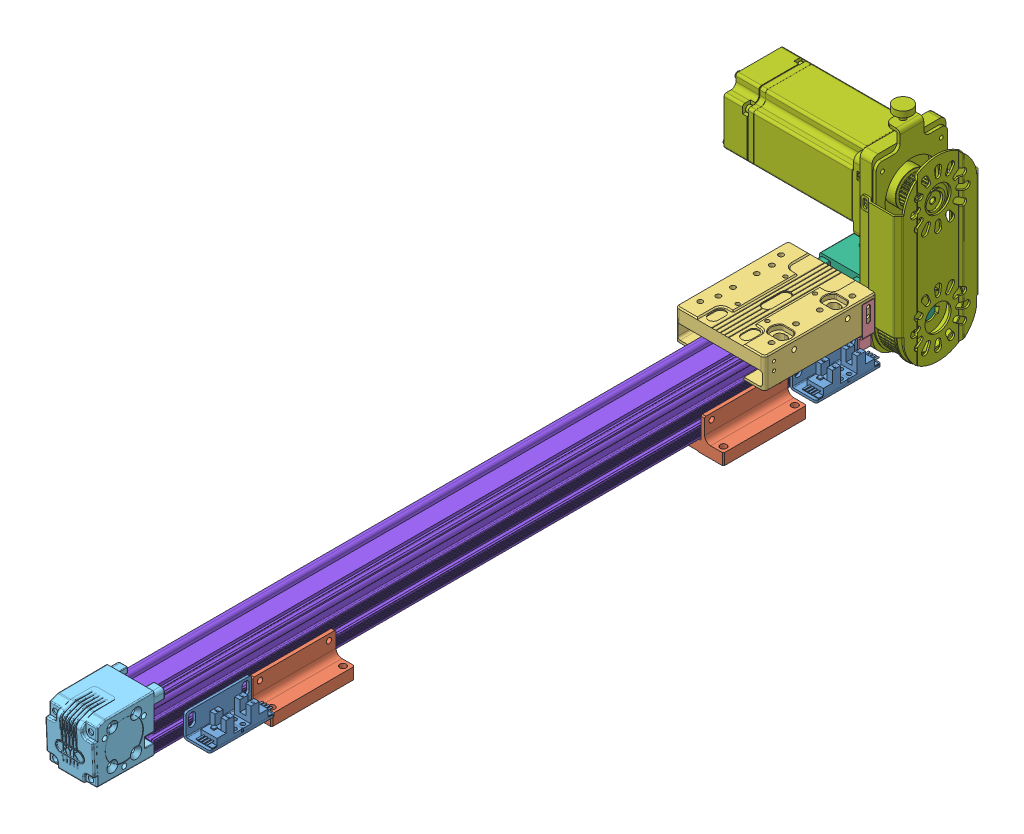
SolidWorks assembly RYK40-转折.SLDASM, configuration 默认 (file format 9000). Lengths in mm.
Overall size (155 174.5 713.43).
15 component instances, 10 part files, 46 mates.
Components (placement in the parent):
- 674光电组合-1: 674光电组合.SLDPRT [默认] at (-227.041 122.2519 117.9175) x (-1 0 0) z (0 0 -1) size (22 20 55.4)
- RY40欧规安装座-1: RY40欧规安装座.SLDPRT [默认] at (-213.9872 100.4811 22.0386) size (78 28 70)
- RY40欧规皮带模组滑块-1: RY40欧规皮带模组滑块.SLDPRT [默认] at (-308.9872 151.5884 -400.5946) x (0 0 -1) z (1 0 0) size (95 25.25 75)
- RY40欧规皮带模组感应片-1: RY40欧规皮带模组感应片.SLDPRT [默认] at (-177.0188 158.2814 -440.9614) x (0 0 -1) z (1 0 0) size (10 36 4)
- RYK40-欧规副同步轮座-1: RYK40-欧规副同步轮座.SLDPRT [默认] at (-422.4567 131.0445 -656.4222) size (40.02 47.72 61.93)
- RYK40-欧规主同步轮座-1A出轴-1: RYK40-欧规主同步轮座-1A出轴.SLDPRT [默认] at (-422.4567 131.0445 -856.4222) size (66.71 47.71 61.93)
- RYK40-欧规轻载皮带模组-400W电机组件-1: RYK40-欧规轻载皮带模组-400W电机组件.SLDPRT [默认] at (-183.9872 178.9811 -487.9614) x (0 0 1) z (-1 0 0) size (71 173 155)
- RYK40-欧规主同步轮座-2B出轴-1: RYK40-欧规主同步轮座-2B出轴.SLDPRT [默认] at (-422.4567 131.0445 -856.4222) (suppressed, hidden)
- RYK40-欧规轻载皮带模组-400W电机组件-3: RYK40-欧规轻载皮带模组-400W电机组件.SLDPRT [默认] at (-243.9872 178.9811 -487.9614) x (0 0 -1) z (1 0 0) size (71 173 155) (suppressed, hidden)
- RYK40-欧规主同步轮座-双出轴-1: RYK40-欧规主同步轮座-双出轴.SLDPRT [默认] at (-422.4567 131.0445 -856.4222) (suppressed, hidden)
- RYK40-欧规轻载皮带模组-400W电机组件-4: RYK40-欧规轻载皮带模组-400W电机组件.SLDPRT [默认] at (-183.9872 178.9811 -487.9614) x (0 0 1) z (-1 0 0) size (71 173 155) (suppressed, hidden)
- RYK40-欧规轻载皮带模组-400W电机组件-5: RYK40-欧规轻载皮带模组-400W电机组件.SLDPRT [默认] at (-243.9872 178.9811 -487.9614) x (0 0 -1) z (1 0 0) size (71 173 155) (suppressed, hidden)
- RYK40型材底座-1: RYK40型材底座.SLDPRT [默认] at (-336.2336 6.9378 -462.9614) size (40 39 600)
- RY40欧规安装座-2: RY40欧规安装座.SLDPRT [默认] at (-213.9872 100.4811 -357.9614) size (78 28 70)
- 674光电组合-2: 674光电组合.SLDPRT [默认] at (-227.041 122.2519 627.9175) x (-1 0 0) z (0 0 -1) size (22 20 55.4)
Mates (geometry in assembly coordinates):
- 重合11: coincident anti-aligned: plane of RYK40-欧规主同步轮座-1A出轴-1 through (-230.9872 151.9811 -462.9614) normal (0 0 1); plane of RYK40型材底座-1 through (-336.2336 6.9378 -462.9614) normal (0 0 -1)
- 重合12: coincident aligned: plane of RYK40-欧规主同步轮座-1A出轴-1 through (-195.4872 109.9811 -462.9614) normal (0 -1 0); plane of RYK40型材底座-1 through (-336.2336 109.9811 137.0386) normal (0 -1 0)
- 宽度4: width aligned: plane of RYK40型材底座-1 through (-233.9872 6.9378 137.0386) normal (-1 0 0); plane of RYK40型材底座-1 through (-193.9872 6.9378 137.0386) normal (1 0 0); plane of RYK40-欧规主同步轮座-1A出轴-1 through (-233.9872 151.9811 -462.9614) normal (-1 0 0); plane of RYK40-欧规主同步轮座-1A出轴-1 through (-193.9872 151.9811 -462.9614) normal (1 0 0)
- 重合13: coincident anti-aligned: plane of RYK40-欧规主同步轮座-2B出轴-1 through (-230.9872 151.9811 -462.9614) normal (0 0 1); plane of RYK40型材底座-1 through (-336.2336 6.9378 -462.9614) normal (0 0 -1)
- 重合14: coincident aligned: plane of RYK40-欧规主同步轮座-2B出轴-1 through (-195.4872 109.9811 -462.9614) normal (0 -1 0); plane of RYK40型材底座-1 through (-336.2336 109.9811 137.0386) normal (0 -1 0)
- 宽度6: width aligned: plane of RYK40型材底座-1 through (-233.9872 6.9378 137.0386) normal (-1 0 0); plane of RYK40型材底座-1 through (-193.9872 6.9378 137.0386) normal (1 0 0); plane of RYK40-欧规主同步轮座-2B出轴-1 through (-233.9872 151.9811 -462.9614) normal (-1 0 0); plane of RYK40-欧规主同步轮座-2B出轴-1 through (-193.9872 151.9811 -462.9614) normal (1 0 0)
- 重合15: coincident anti-aligned: plane of RYK40-欧规副同步轮座-1 through (-193.7472 109.9811 137.0386) normal (0 0 -1); plane of RYK40型材底座-1 through (-336.2336 6.9378 137.0386) normal (0 0 1)
- 重合17: coincident aligned: plane of RYK40-欧规副同步轮座-1 through (-204.5872 109.9811 177.0386) normal (0 -1 0); plane of RYK40型材底座-1 through (-336.2336 109.9811 137.0386) normal (0 -1 0)
- 重合21: coincident aligned: plane of RYK40-欧规副同步轮座-1 through (-193.9872 146.9811 129.5386) normal (1 0 0); plane of RYK40-欧规主同步轮座-2B出轴-1 through (-193.9872 146.9811 -455.4614) normal (1 0 0)
- 宽度11: width aligned: plane of RY40欧规皮带模组滑块-1 through (-176.4872 161.2811 -358.9614) normal (1 0 0); plane of RY40欧规皮带模组滑块-1 through (-251.4872 161.2811 -358.9614) normal (-1 0 0); plane of RYK40型材底座-1 through (-193.9872 6.9378 137.0386) normal (1 0 0); plane of RYK40型材底座-1 through (-233.9872 6.9378 137.0386) normal (-1 0 0)
- 重合26: coincident anti-aligned: plane of RY40欧规皮带模组滑块-1 through (-251.4872 161.2811 -453.9614) normal (0 0 -1); plane of RYK40-欧规主同步轮座-1A出轴-1 through (-230.4872 151.4811 -453.9614) normal (0 0 1)
- 重合30: coincident anti-aligned: plane of 674光电组合-1 through (-193.9872 129.9811 -452.9614) normal (-1 0 0); plane of RYK40型材底座-1 through (-193.9872 6.9378 137.0386) normal (1 0 0)
- 重合31: coincident aligned: plane of 674光电组合-1 through (-193.9872 109.9811 -452.9614) normal (0 -1 0); plane of RYK40型材底座-1 through (-336.2336 109.9811 137.0386) normal (0 -1 0)
- 距离5: distance = 10 mm aligned: plane of 674光电组合-1 through (-191.9872 112.7177 -452.9614) normal (0 0 -1); plane of RYK40型材底座-1 through (-336.2336 6.9378 -462.9614) normal (0 0 -1)
- 重合35: coincident anti-aligned: plane of RYK40型材底座-1 through (-193.9872 6.9378 137.0386) normal (1 0 0); plane of 674光电组合-2 through (-193.9872 129.9811 57.0386) normal (-1 0 0)
- 距离6: distance = 25 mm aligned: plane of 674光电组合-2 through (-191.2506 112.7177 112.0386) normal (0 0 1); plane of RYK40型材底座-1 through (-336.2336 6.9378 137.0386) normal (0 0 1)
- 重合37: coincident aligned: plane of 674光电组合-1 through (-193.9872 109.9811 -452.9614) normal (0 -1 0); plane of 674光电组合-2 through (-193.9872 109.9811 57.0386) normal (0 -1 0)
- 同心1: concentric aligned: cylinder of RY40欧规皮带模组滑块-1 through (-176.4872 154.2814 -445.9614) axis (1 0 0) radius 1.25; cylinder of RY40欧规皮带模组感应片-1 through (-180.0188 154.2814 -445.9614) axis (1 0 0) radius 1.75
- 同心2: concentric aligned: cylinder of RYK40-欧规主同步轮座-1A出轴-1 through (-230.8372 133.9811 -487.9614) axis (1 0 0) radius 6; cylinder of RYK40-欧规轻载皮带模组-400W电机组件-1 through (-193.9872 133.9811 -487.9614) axis (1 0 0) radius 10
- 重合38: coincident anti-aligned: plane of RYK40-欧规主同步轮座-1A出轴-1 through (-193.9872 151.9811 -462.9614) normal (1 0 0); plane of RYK40-欧规轻载皮带模组-400W电机组件-1 through (-193.9872 178.9811 -487.9614) normal (-1 0 0)
- 平行1: parallel aligned: plane of RYK40-欧规主同步轮座-1A出轴-1 through (-195.4872 109.9811 -462.9614) normal (0 -1 0); plane of RYK40-欧规轻载皮带模组-400W电机组件-1 through (-193.9872 103.9811 -518.9614) normal (0 -1 0)
- 重合39: coincident anti-aligned: plane of RYK40-欧规主同步轮座-2B出轴-1 through (-233.9872 151.9811 -462.9614) normal (-1 0 0); plane of RYK40-欧规轻载皮带模组-400W电机组件-3 through (-233.9872 178.9811 -487.9614) normal (1 0 0)
- 同心3: concentric anti-aligned: cylinder of RYK40-欧规主同步轮座-2B出轴-1 through (-230.8372 133.9811 -487.9614) axis (1 0 0) radius 6; cylinder of RYK40-欧规轻载皮带模组-400W电机组件-3 through (-233.9872 133.9811 -487.9614) axis (-1 0 0) radius 10
- 重合40: coincident aligned: plane of RYK40-欧规轻载皮带模组-400W电机组件-1 through (-193.9872 103.9811 -518.9614) normal (0 -1 0); plane of RYK40-欧规轻载皮带模组-400W电机组件-3 through (-233.9872 103.9811 -456.9614) normal (0 -1 0)
- 重合41: coincident anti-aligned: plane of RY40欧规皮带模组滑块-1 through (-251.4872 161.2811 -453.9614) normal (0 0 -1); plane of RYK40-欧规主同步轮座-2B出轴-1 through (-230.4872 151.4811 -453.9614) normal (0 0 1)
- 同心4: concentric aligned: cylinder of RYK40-欧规主同步轮座-2B出轴-1 through (-196.3872 133.9811 -487.9614) axis (-1 0 0) radius 6; cylinder of RYK40-欧规轻载皮带模组-400W电机组件-3 through (-233.9872 133.9811 -487.9614) axis (-1 0 0) radius 10
- 重合42: coincident anti-aligned: plane of RYK40-欧规主同步轮座-2B出轴-1 through (-233.9872 151.9811 -462.9614) normal (-1 0 0); plane of RYK40-欧规轻载皮带模组-400W电机组件-3 through (-233.9872 178.9811 -487.9614) normal (1 0 0)
- 平行3: parallel aligned: plane of RY40欧规皮带模组滑块-1 through (-213.9872 161.2811 -406.4614) normal (0 1 0); plane of RYK40-欧规轻载皮带模组-400W电机组件-3 through (-233.9872 253.9811 -456.9614) normal (0 1 0)
- 重合46: coincident anti-aligned: plane of RYK40-欧规主同步轮座-双出轴-1 through (-230.9872 151.9811 -462.9614) normal (0 0 1); plane of RYK40型材底座-1 through (-336.2336 6.9378 -462.9614) normal (0 0 -1)
- 重合47: coincident aligned: plane of RYK40-欧规主同步轮座-双出轴-1 through (-195.4872 109.9811 -462.9614) normal (0 -1 0); plane of RYK40型材底座-1 through (-336.2336 109.9811 137.0386) normal (0 -1 0)
- 重合48: coincident aligned: plane of RYK40-欧规主同步轮座-双出轴-1 through (-233.9872 151.9811 -462.9614) normal (-1 0 0); plane of RYK40型材底座-1 through (-233.9872 6.9378 137.0386) normal (-1 0 0)
- 重合49: coincident anti-aligned: plane of RY40欧规皮带模组滑块-1 through (-251.4872 161.2811 -453.9614) normal (0 0 -1); plane of RYK40-欧规主同步轮座-双出轴-1 through (-197.2372 148.4915 -453.9614) normal (0 0 1)
- 同心5: concentric aligned: cylinder of RYK40-欧规主同步轮座-双出轴-1 through (-230.8372 133.9811 -487.9614) axis (1 0 0) radius 6; cylinder of RYK40-欧规轻载皮带模组-400W电机组件-4 through (-193.9872 133.9811 -487.9614) axis (1 0 0) radius 10
- 重合50: coincident anti-aligned: plane of RYK40-欧规主同步轮座-双出轴-1 through (-193.9872 151.9811 -462.9614) normal (1 0 0); plane of RYK40-欧规轻载皮带模组-400W电机组件-4 through (-193.9872 178.9811 -487.9614) normal (-1 0 0)
- 同心6: concentric aligned: cylinder of RYK40-欧规主同步轮座-双出轴-1 through (-196.3872 133.9811 -487.9614) axis (-1 0 0) radius 6; cylinder of RYK40-欧规轻载皮带模组-400W电机组件-5 through (-233.9872 133.9811 -487.9614) axis (-1 0 0) radius 10
- 重合51: coincident anti-aligned: plane of RYK40-欧规主同步轮座-双出轴-1 through (-233.9872 151.9811 -462.9614) normal (-1 0 0); plane of RYK40-欧规轻载皮带模组-400W电机组件-5 through (-233.9872 178.9811 -487.9614) normal (1 0 0)
- 平行4: parallel aligned: plane of RY40欧规皮带模组滑块-1 through (-213.9872 161.2811 -406.4614) normal (0 1 0); plane of RYK40-欧规轻载皮带模组-400W电机组件-5 through (-233.9872 253.9811 -456.9614) normal (0 1 0)
- 平行5: parallel aligned: plane of RY40欧规皮带模组滑块-1 through (-213.9872 161.2811 -406.4614) normal (0 1 0); plane of RYK40-欧规轻载皮带模组-400W电机组件-4 through (-193.9872 253.9811 -518.9614) normal (0 1 0)
- 同心7: concentric anti-aligned: cylinder of RYK40-欧规副同步轮座-1 through (-197.9872 143.9811 140.0386) axis (0 0 -1) radius 3.25; cylinder of RYK40型材底座-1 through (-197.9872 143.9811 -471.4467) axis (0 0 1) radius 3
- 重合52: coincident anti-aligned: plane of RYK40型材底座-1 through (-336.2336 109.9811 137.0386) normal (0 -1 0); plane of RY40欧规安装座-2 through (-213.9872 109.9811 -357.9614) normal (0 1 0)
- 宽度12: width anti-aligned: plane of RY40欧规安装座-2 through (-190.8372 123.4811 -327.9614) normal (1 0 0); plane of RY40欧规安装座-2 through (-237.1372 123.4811 -387.9614) normal (-1 0 0); plane of RYK40型材底座-1 through (-233.9872 6.9378 137.0386) normal (-1 0 0); plane of RYK40型材底座-1 through (-193.9872 6.9378 137.0386) normal (1 0 0)
- 距离7: distance = 70 mm aligned: plane of RY40欧规安装座-2 through (-252.9872 109.9811 -392.9614) normal (0 0 -1); plane of RYK40型材底座-1 through (-336.2336 6.9378 -462.9614) normal (0 0 -1)
- 宽度13: width anti-aligned: plane of RY40欧规安装座-1 through (-190.8372 123.4811 52.0386) normal (1 0 0); plane of RY40欧规安装座-1 through (-237.1372 123.4811 -7.9614) normal (-1 0 0); plane of RYK40型材底座-1 through (-233.9872 6.9378 137.0386) normal (-1 0 0); plane of RYK40型材底座-1 through (-193.9872 6.9378 137.0386) normal (1 0 0)
- 重合54: coincident anti-aligned: plane of RY40欧规安装座-1 through (-213.9872 109.9811 22.0386) normal (0 1 0); plane of RYK40型材底座-1 through (-336.2336 109.9811 137.0386) normal (0 -1 0)
- 距离8: distance = 80 mm aligned: plane of RY40欧规安装座-1 through (-252.9872 109.9811 57.0386) normal (0 0 1); plane of RYK40型材底座-1 through (-336.2336 6.9378 137.0386) normal (0 0 1)
- 距离9: distance = 60.8 mm anti-aligned: plane of RY40欧规皮带模组滑块-1 through (-213.9872 161.2811 -406.4614) normal (0 1 0); plane of RY40欧规安装座-2 through (-213.9872 100.4811 -357.9614) normal (0 -1 0)
